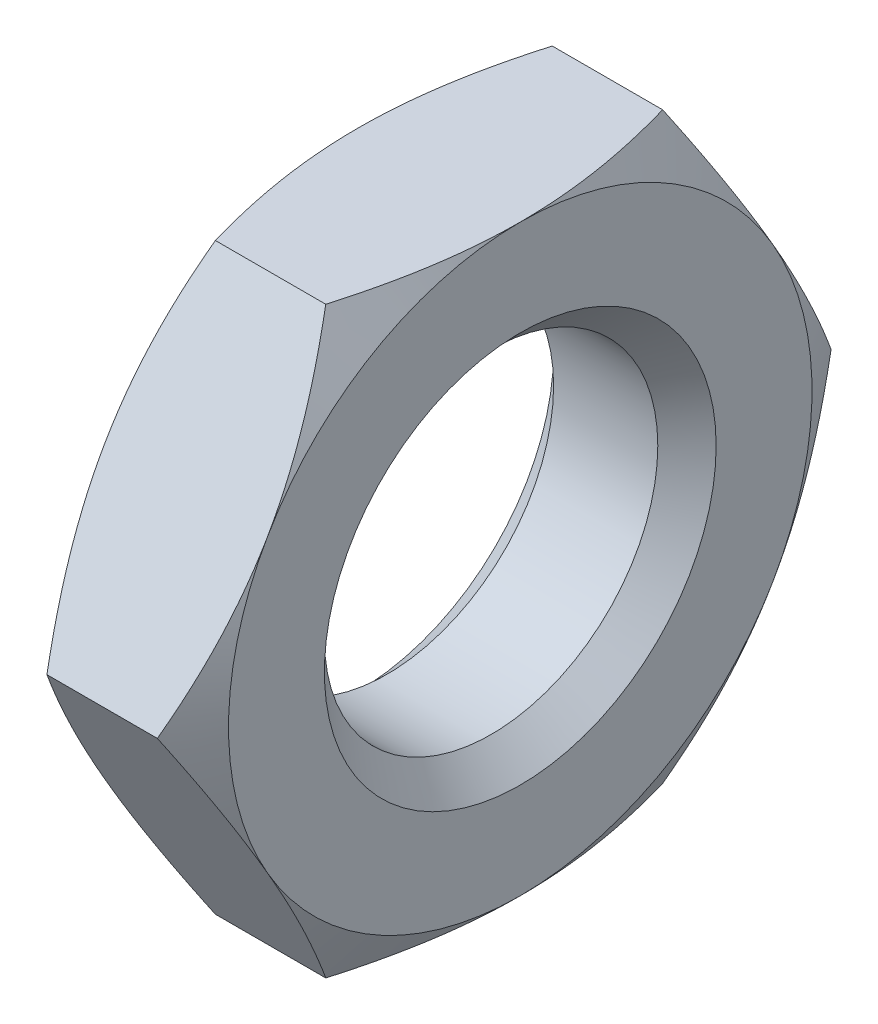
from build123d import *

# Parameters (mm, degrees)
SKETCH1_R      = 2
EXTRUDE1_DEPTH = 1.95
CHAMFER1_SIZE  = 0.35


with BuildPart() as part:
    # Sketch1 → Extrude1 (new body)
    with BuildSketch(Plane(origin=(0, 0, 0), x_dir=(0, 0, -1), z_dir=(1, 0, 0))):
        Polygon((2.020725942, 3.5), (-2.020725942, 3.5), (-4.041451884, 0), (-2.020725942, -3.5), (2.020725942, -3.5), (4.041451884, 0), align=None)
        Circle(SKETCH1_R, mode=Mode.SUBTRACT)
    extrude(amount=EXTRUDE1_DEPTH)

    # Sketch2 → Cut-Revolve1 (revolve, cut)
    with BuildSketch(Plane.XY):
        Polygon((1.95, 3.5), (1.95, 14), (0, 14), (0, 3.5), (0.975, 5.188749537), align=None)
    revolve(axis=Axis((1.95, 0, 0), (-1, 0, 0)), mode=Mode.SUBTRACT)

    # Chamfer1
    chamfer1_edges = [part.edges().sort_by_distance(p)[0] for p in [
        (0, 0, 2),
        (1.95, 0, 2),
    ]]
    chamfer(chamfer1_edges, length=CHAMFER1_SIZE)


solid = part.part
